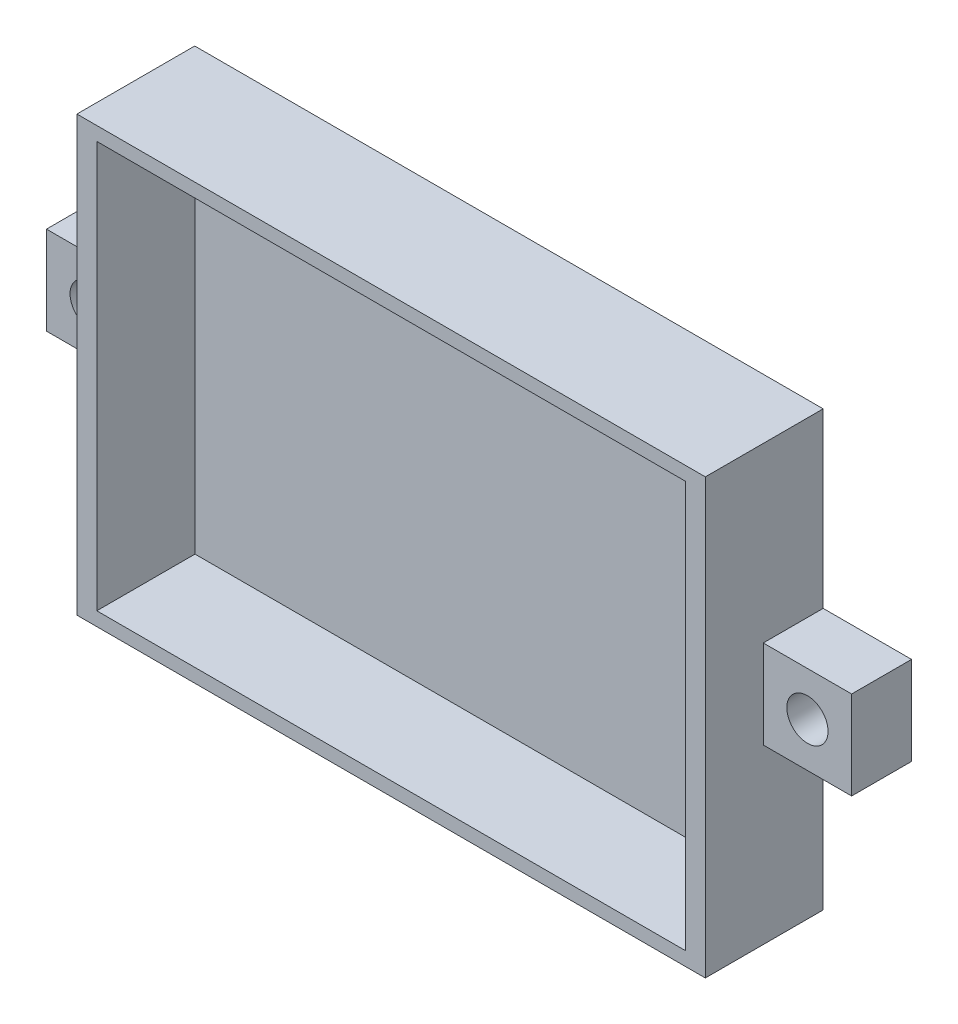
from build123d import *

# Parameters (mm, degrees)
BOSS_EXTRUDE1_DEPTH = 2
SKETCH1_3_W         = 9
SKETCH1_3_H         = 9
SKETCH1_3_R         = 2.1
BOSS_EXTRUDE2_DEPTH = 6.1
SKETCH3_W           = 64
SKETCH3_H           = 44.2
SKETCH3_W_2         = 59.945701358
SKETCH3_H_2         = 41.4
BOSS_EXTRUDE3_DEPTH = 10


with BuildPart() as part:
    # Sketch1 → Boss-Extrude1 (new body)
    with BuildSketch(Plane.XY):
        Polygon((32, 4.5), (32, 22.1), (-32, 22.1), (-32, 4.5), (-32, -4.5), (-32, -22.1), (32, -22.1), (32, -4.5), align=None)
    extrude(amount=BOSS_EXTRUDE1_DEPTH)

    # Sketch1_3 → Boss-Extrude2 (add)
    # profile 1 of 2: a face of its own
    with BuildSketch(Plane.XY):
        with Locations((-36.5, 0)):
            Rectangle(SKETCH1_3_W, SKETCH1_3_H)
        with Locations((-36.5, 0)):
            Circle(SKETCH1_3_R, mode=Mode.SUBTRACT)
    # profile 2 of 2: a face of its own
    with BuildSketch(Plane.XY):
        with Locations((36.5, 0)):
            Rectangle(SKETCH1_3_W, SKETCH1_3_H)
        with Locations((36.5, 0)):
            Circle(SKETCH1_3_R, mode=Mode.SUBTRACT)
    extrude(amount=BOSS_EXTRUDE2_DEPTH)

    # Sketch3 → Boss-Extrude3 (add)
    with BuildSketch(Plane.XY.offset(2)):
        Rectangle(SKETCH3_W, SKETCH3_H)
        Rectangle(SKETCH3_W_2, SKETCH3_H_2, mode=Mode.SUBTRACT)
    extrude(amount=BOSS_EXTRUDE3_DEPTH)


solid = part.part
